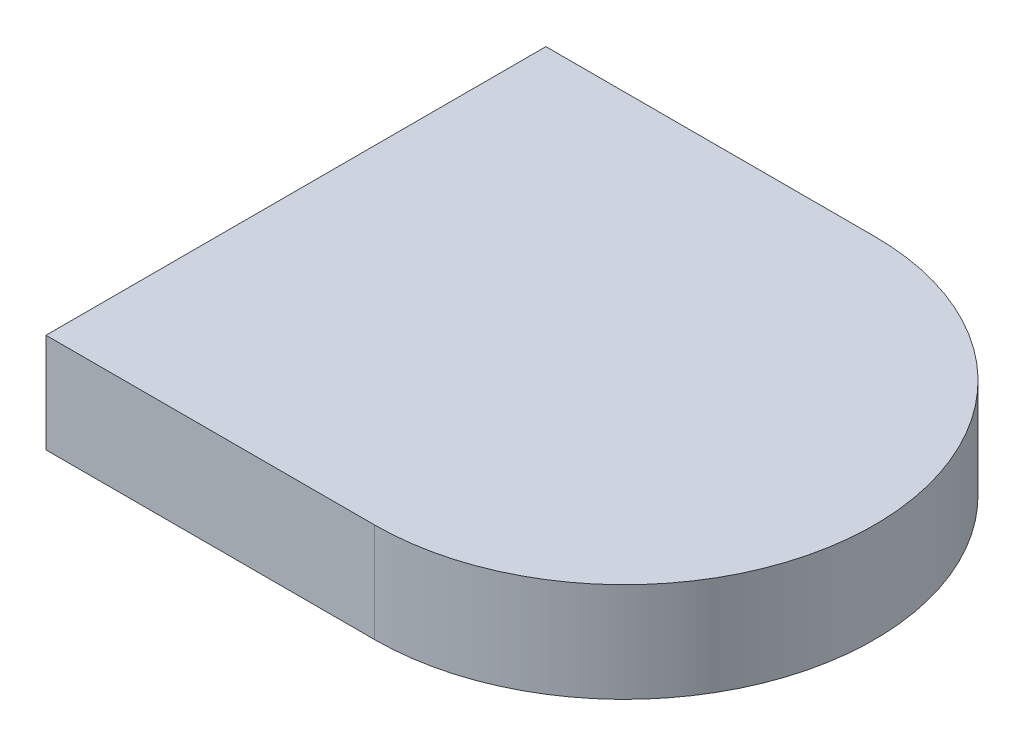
from build123d import *

# Parameters (mm, degrees)
EXTRUDE1_DEPTH = 30


with BuildPart() as part:
    # Sketch1 → Extrude1 (new body)
    with BuildSketch(Plane(origin=(0, 0, 0), x_dir=(1, 0, 0), z_dir=(0, 1, 0))):
        with BuildLine():
            Line((0, 75.509067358), (-99.269253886, 75.509067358))
            Line((-99.269253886, 75.509067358), (-99.269253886, -75.509067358))
            Line((-99.269253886, -75.509067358), (0, -75.509067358))
            ThreePointArc((0, -75.509067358), (75.509067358, 0), (0, 75.509067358))
        make_face()
    extrude(amount=EXTRUDE1_DEPTH)


solid = part.part
